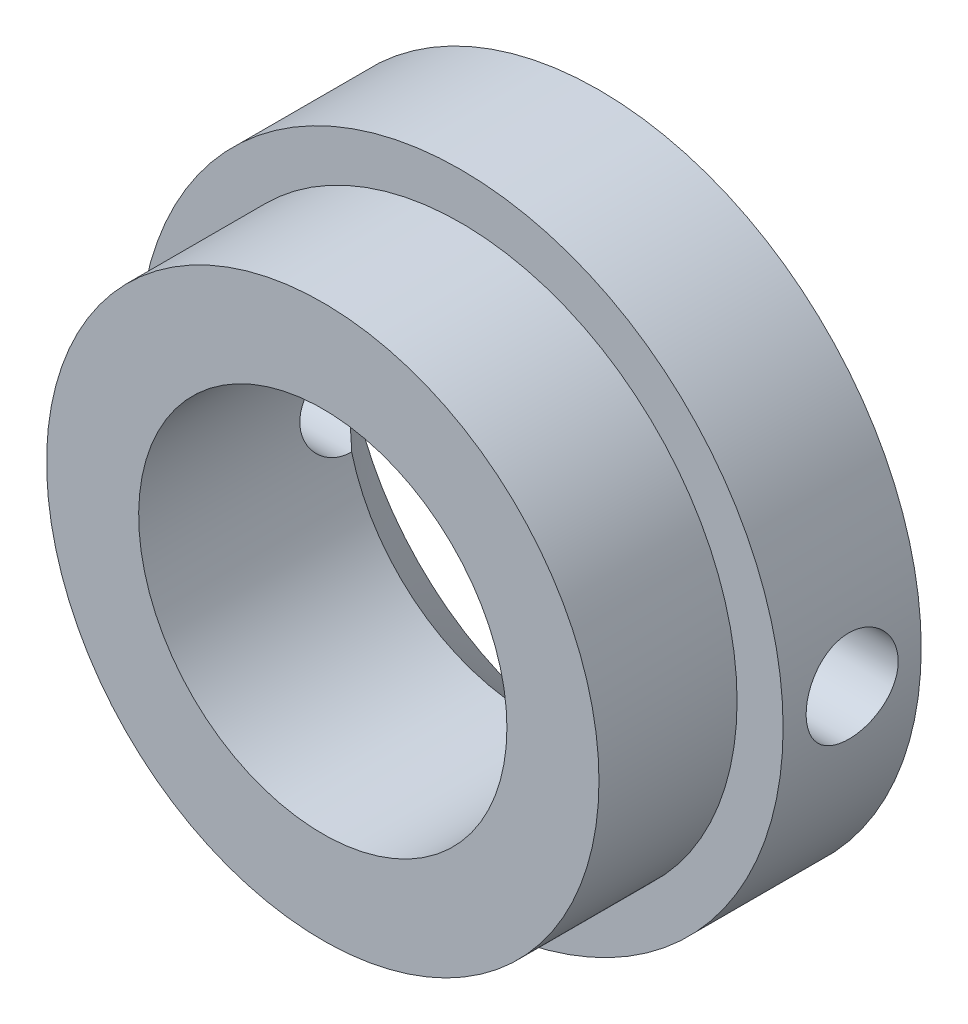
from build123d import *

# Parameters (mm, degrees)
ESQUISSE1_R                                    = 7
BOSS_EXTRU_1_DEPTH                             = 3
ESQUISSE2_R                                    = 6
BOSS_EXTRU_2_DEPTH                             = 3
FRAISAGE_POUR_VIS_T_TE_FRAIS_E_M51_D           = 8
FRAISAGE_POUR_VIS_T_TE_FRAIS_E_M51_CSINK_D     = 11
FRAISAGE_POUR_VIS_T_TE_FRAIS_E_M51_CSINK_ANGLE = 90
DIAM_TRE_DU_PER_AGE_0_15_0_15_1_D              = 2


with BuildPart() as part:
    # Esquisse1 → Boss.-Extru.1 (new body)
    with BuildSketch(Plane.XY):
        Circle(ESQUISSE1_R)
    extrude(amount=BOSS_EXTRU_1_DEPTH)

    # Esquisse2 → Boss.-Extru.2 (add)
    with BuildSketch(Plane.XY.offset(3)):
        Circle(ESQUISSE2_R)
    extrude(amount=BOSS_EXTRU_2_DEPTH)

    # Fraisage pour vis _ t_te frais_e M51 (through all)
    with Locations(Plane(origin=(0, 0, 0), x_dir=(-1, 0, 0), z_dir=(0, 0, -1))):
        with Locations((0, 0)):
            CounterSinkHole(FRAISAGE_POUR_VIS_T_TE_FRAIS_E_M51_D / 2, FRAISAGE_POUR_VIS_T_TE_FRAIS_E_M51_CSINK_D / 2, counter_sink_angle=FRAISAGE_POUR_VIS_T_TE_FRAIS_E_M51_CSINK_ANGLE)

    # Diam_tre du per_age _0.15 _0.15_1 (through all)
    with Locations(Plane(origin=(7, 0, 0), x_dir=(0, 0, -1), z_dir=(1, 0, 0))):
        with Locations((-1.5, 0)):
            Hole(DIAM_TRE_DU_PER_AGE_0_15_0_15_1_D / 2)


solid = part.part
